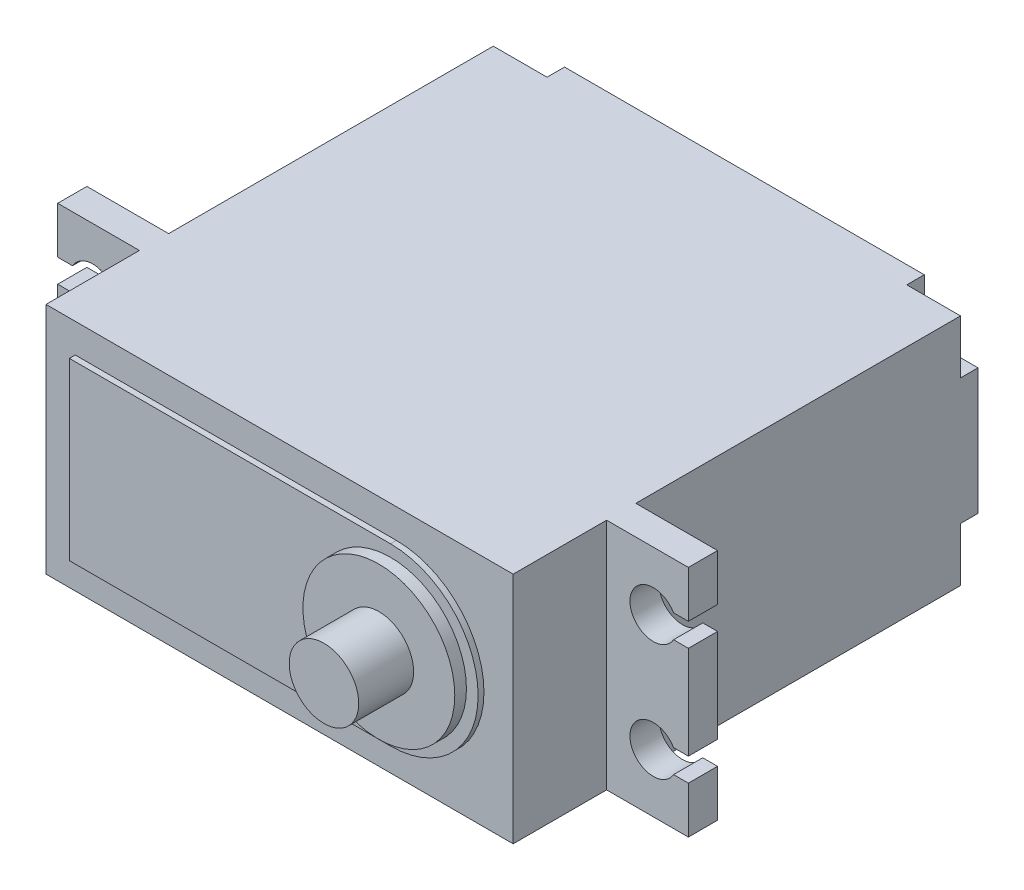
from build123d import *

# Parameters (mm, degrees)
SKETCH_1_W          = 40
SKETCH_1_H          = 20
EXTRUDE_1_DEPTH     = 39.8
CUT_EXTRUDE_1_DEPTH = 1.5
SKETCH_3_W          = 2.5
SKETCH_3_H          = 20
EXTRUDE_2_DEPTH     = 7
CUT_EXTRUDE_2_DEPTH = 7
EXTRUDE_3_DEPTH     = 0.5
SKETCH_6_R          = 6.5
EXTRUDE_4_DEPTH     = 1
EXTRUDE_START       = -1
SKETCH_7_R          = 2.975
EXTRUDE_5_DEPTH     = 5.7


with BuildPart() as part:
    # Sketch 1 → Extrude 1 (new body)
    with BuildSketch(Plane.XY):
        Rectangle(SKETCH_1_W, SKETCH_1_H)
    extrude(amount=EXTRUDE_1_DEPTH)

    # Sketch 2 → Cut-Extrude 1 (cut)
    with BuildSketch(Plane(origin=(0, 0, 0), x_dir=(-1, 0, 0), z_dir=(0, 0, -1))):
        with BuildLine():
            Line((20, -10), (20, -5.4))
            Line((20, -5.4), (18.4, -5.4))
            ThreePointArc((18.4, -5.4), (16.278679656, -6.278679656), (15.4, -8.4))
            Line((15.4, -8.4), (15.4, -10))
            Line((15.4, -10), (20, -10))
        make_face()
        with BuildLine():
            Line((20, 10), (15.4, 10))
            Line((15.4, 10), (15.4, 8.4))
            ThreePointArc((15.4, 8.4), (16.278679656, 6.278679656), (18.4, 5.4))
            Line((18.4, 5.4), (20, 5.4))
            Line((20, 5.4), (20, 10))
        make_face()
        with BuildLine():
            Line((-15.4, 8.4), (-15.4, 10))
            Line((-15.4, 10), (-20, 10))
            Line((-20, 10), (-20, 5.4))
            Line((-20, 5.4), (-18.4, 5.4))
            ThreePointArc((-18.4, 5.4), (-16.278679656, 6.278679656), (-15.4, 8.4))
        make_face()
        with BuildLine():
            Line((-18.4, -5.4), (-20, -5.4))
            Line((-20, -5.4), (-20, -10))
            Line((-20, -10), (-15.4, -10))
            Line((-15.4, -10), (-15.4, -8.4))
            ThreePointArc((-15.4, -8.4), (-16.278679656, -6.278679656), (-18.4, -5.4))
        make_face()
    extrude(amount=-CUT_EXTRUDE_1_DEPTH, mode=Mode.SUBTRACT)

    # Sketch 3 → Extrude 2 (add)
    with BuildSketch(Plane.ZY.offset(20)):
        with Locations((30.55, 0)):
            Rectangle(SKETCH_3_W, SKETCH_3_H)
    extrude_2 = extrude(amount=EXTRUDE_2_DEPTH)

    # Sketch 4 → Cut-Extrude 2 (cut)
    with BuildSketch(Plane.XY.offset(31.8)):
        with BuildLine():
            Line((-27.640313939, 6), (-27.640313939, 4))
            Line((-27.640313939, 4), (-25.732050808, 4))
            ThreePointArc((-25.732050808, 4), (-22, 5), (-25.732050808, 6))
            Line((-25.732050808, 6), (-27.640313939, 6))
        make_face()
        with BuildLine():
            Line((-25.732050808, -6), (-27.640313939, -6))
            Line((-27.640313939, -6), (-27.640313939, -4))
            Line((-27.640313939, -4), (-25.732050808, -4))
            ThreePointArc((-25.732050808, -4), (-22, -5), (-25.732050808, -6))
        make_face()
    cut_extrude_2 = extrude(amount=-CUT_EXTRUDE_2_DEPTH, mode=Mode.SUBTRACT)

    # Mirror 1: Extrude 2, Cut-Extrude 2 across plane
    add(extrude_2.mirror(Plane(origin=(0, 0, 0), x_dir=(0, 0, 1), z_dir=(1, 0, 0))))
    add(cut_extrude_2.mirror(Plane(origin=(0, 0, 0), x_dir=(0, 0, 1), z_dir=(1, 0, 0))), mode=Mode.SUBTRACT)

    # Sketch 5 → Extrude 3 (add)
    with BuildSketch(Plane.XY.offset(39.8)):
        with BuildLine():
            Line((10, -7.5), (-17.5, -7.5))
            Line((-17.5, -7.5), (-17.5, 7.5))
            Line((-17.5, 7.5), (10, 7.5))
            ThreePointArc((10, 7.5), (17.5, 0), (10, -7.5))
        make_face()
    extrude(amount=EXTRUDE_3_DEPTH)

    # Sketch 6 → Extrude 4 (add)
    with BuildSketch(Plane.XY.offset(40.3)):
        with Locations((10, 0)):
            Circle(SKETCH_6_R)
    extrude(amount=EXTRUDE_4_DEPTH)

    # Sketch 7 → Extrude 5 (add)
    with BuildSketch(Plane.XY.offset(41.3).offset(EXTRUDE_START)):
        with Locations((10, 0)):
            Circle(SKETCH_7_R)
    extrude(amount=EXTRUDE_5_DEPTH)


solid = part.part
